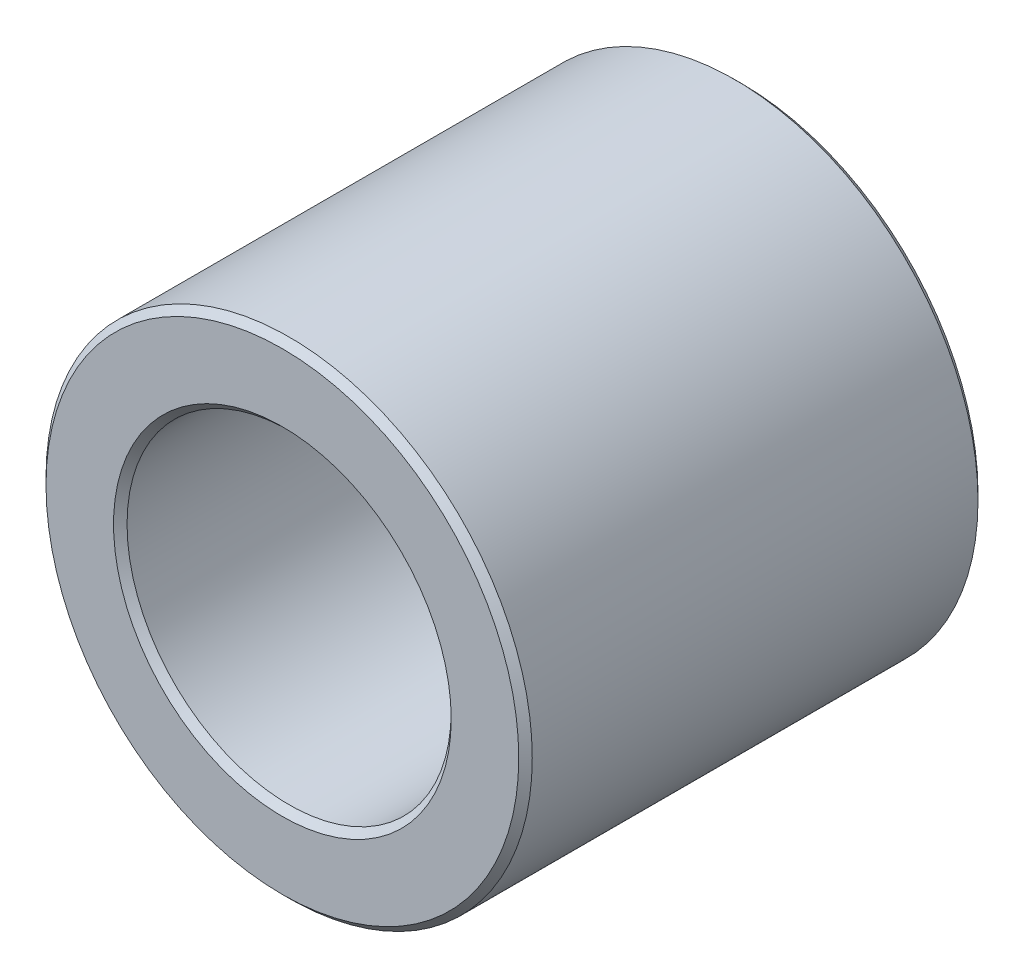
ISO-10303-21;
HEADER;
FILE_DESCRIPTION(('STEP AP214'),'2;1');
FILE_NAME('part.step','',(''),(''),'','','');
FILE_SCHEMA(('AUTOMOTIVE_DESIGN { 1 0 10303 214 1 1 1 1 }'));
ENDSEC;
DATA;
#1=APPLICATION_CONTEXT('core data for automotive mechanical design processes');
#2=APPLICATION_PROTOCOL_DEFINITION('international standard','automotive_design',2000,#1);
#3=PRODUCT_CONTEXT('',#1,'mechanical');
#4=PRODUCT('Part','Part','',(#3));
#5=PRODUCT_RELATED_PRODUCT_CATEGORY('part','',(#4));
#6=PRODUCT_DEFINITION_FORMATION('','',#4);
#7=PRODUCT_DEFINITION_CONTEXT('part definition',#1,'design');
#8=PRODUCT_DEFINITION('design','',#6,#7);
#9=PRODUCT_DEFINITION_SHAPE('','',#8);
#10=(LENGTH_UNIT() NAMED_UNIT(*) SI_UNIT(.MILLI.,.METRE.));
#11=(NAMED_UNIT(*) PLANE_ANGLE_UNIT() SI_UNIT($,.RADIAN.));
#12=(NAMED_UNIT(*) SI_UNIT($,.STERADIAN.) SOLID_ANGLE_UNIT());
#13=UNCERTAINTY_MEASURE_WITH_UNIT(LENGTH_MEASURE(1.E-05),#10,'distance_accuracy_value','');
#14=(GEOMETRIC_REPRESENTATION_CONTEXT(3) GLOBAL_UNCERTAINTY_ASSIGNED_CONTEXT((#13)) GLOBAL_UNIT_ASSIGNED_CONTEXT((#10,
#11,#12)) REPRESENTATION_CONTEXT('',''));
#15=CARTESIAN_POINT('',(0.,0.,0.));
#16=DIRECTION('',(0.,0.,1.));
#17=DIRECTION('',(1.,0.,0.));
#18=AXIS2_PLACEMENT_3D('',#15,#16,#17);
#19=CARTESIAN_POINT('',(0.,0.,-17.));
#20=DIRECTION('',(0.,0.,1.));
#21=DIRECTION('',(1.,0.,0.));
#22=AXIS2_PLACEMENT_3D('',#19,#20,#21);
#23=CYLINDRICAL_SURFACE('',#22,9.);
#24=CARTESIAN_POINT('',(0.,0.,-16.75));
#25=DIRECTION('',(0.,0.,1.));
#26=DIRECTION('',(1.,0.,0.));
#27=AXIS2_PLACEMENT_3D('',#24,#25,#26);
#28=CIRCLE('',#27,9.);
#29=CARTESIAN_POINT('',(9.,0.,-16.75));
#30=VERTEX_POINT('',#29);
#31=EDGE_CURVE('E53',#30,#30,#28,.T.);
#32=ORIENTED_EDGE('',*,*,#31,.T.);
#33=EDGE_LOOP('',(#32));
#34=FACE_BOUND('',#33,.T.);
#35=CARTESIAN_POINT('',(0.,0.,-0.25));
#36=DIRECTION('',(0.,0.,1.));
#37=DIRECTION('',(1.,0.,0.));
#38=AXIS2_PLACEMENT_3D('',#35,#36,#37);
#39=CIRCLE('',#38,9.);
#40=CARTESIAN_POINT('',(9.,0.,-0.25));
#41=VERTEX_POINT('',#40);
#42=EDGE_CURVE('E56',#41,#41,#39,.F.);
#43=ORIENTED_EDGE('',*,*,#42,.T.);
#44=EDGE_LOOP('',(#43));
#45=FACE_BOUND('',#44,.T.);
#46=ADVANCED_FACE('F28',(#34,#45),#23,.T.);
#47=CARTESIAN_POINT('',(0.,0.,-17.));
#48=DIRECTION('',(0.,0.,1.));
#49=DIRECTION('',(1.,0.,0.));
#50=AXIS2_PLACEMENT_3D('',#47,#48,#49);
#51=PLANE('',#50);
#52=CARTESIAN_POINT('',(0.,0.,-17.));
#53=DIRECTION('',(0.,0.,1.));
#54=DIRECTION('',(1.,0.,0.));
#55=AXIS2_PLACEMENT_3D('',#52,#53,#54);
#56=CIRCLE('',#55,8.75);
#57=CARTESIAN_POINT('',(8.75,0.,-17.));
#58=VERTEX_POINT('',#57);
#59=EDGE_CURVE('E47',#58,#58,#56,.F.);
#60=ORIENTED_EDGE('',*,*,#59,.T.);
#61=EDGE_LOOP('',(#60));
#62=FACE_BOUND('',#61,.T.);
#63=CARTESIAN_POINT('',(0.,0.,-17.));
#64=DIRECTION('',(0.,0.,1.));
#65=DIRECTION('',(1.,0.,0.));
#66=AXIS2_PLACEMENT_3D('',#63,#64,#65);
#67=CIRCLE('',#66,6.25);
#68=CARTESIAN_POINT('',(6.25,0.,-17.));
#69=VERTEX_POINT('',#68);
#70=EDGE_CURVE('E50',#69,#69,#67,.T.);
#71=ORIENTED_EDGE('',*,*,#70,.T.);
#72=EDGE_LOOP('',(#71));
#73=FACE_BOUND('',#72,.T.);
#74=ADVANCED_FACE('F77',(#62,#73),#51,.F.);
#75=CARTESIAN_POINT('',(0.,0.,0.));
#76=DIRECTION('',(0.,0.,1.));
#77=DIRECTION('',(1.,0.,0.));
#78=AXIS2_PLACEMENT_3D('',#75,#76,#77);
#79=PLANE('',#78);
#80=CARTESIAN_POINT('',(0.,0.,0.));
#81=DIRECTION('',(0.,0.,1.));
#82=DIRECTION('',(1.,0.,0.));
#83=AXIS2_PLACEMENT_3D('',#80,#81,#82);
#84=CIRCLE('',#83,8.75);
#85=CARTESIAN_POINT('',(8.75,0.,0.));
#86=VERTEX_POINT('',#85);
#87=EDGE_CURVE('E10',#86,#86,#84,.T.);
#88=ORIENTED_EDGE('',*,*,#87,.T.);
#89=EDGE_LOOP('',(#88));
#90=FACE_BOUND('',#89,.T.);
#91=CARTESIAN_POINT('',(0.,0.,0.));
#92=DIRECTION('',(0.,0.,1.));
#93=DIRECTION('',(1.,0.,0.));
#94=AXIS2_PLACEMENT_3D('',#91,#92,#93);
#95=CIRCLE('',#94,6.25);
#96=CARTESIAN_POINT('',(6.25,0.,0.));
#97=VERTEX_POINT('',#96);
#98=EDGE_CURVE('E34',#97,#97,#95,.F.);
#99=ORIENTED_EDGE('',*,*,#98,.T.);
#100=EDGE_LOOP('',(#99));
#101=FACE_BOUND('',#100,.T.);
#102=ADVANCED_FACE('F82',(#90,#101),#79,.T.);
#103=CARTESIAN_POINT('',(0.,0.,-17.));
#104=DIRECTION('',(0.,0.,1.));
#105=DIRECTION('',(1.,0.,0.));
#106=AXIS2_PLACEMENT_3D('',#103,#104,#105);
#107=CYLINDRICAL_SURFACE('',#106,6.);
#108=CARTESIAN_POINT('',(0.,0.,-16.75));
#109=DIRECTION('',(0.,0.,1.));
#110=DIRECTION('',(1.,0.,0.));
#111=AXIS2_PLACEMENT_3D('',#108,#109,#110);
#112=CIRCLE('',#111,6.);
#113=CARTESIAN_POINT('',(6.,0.,-16.75));
#114=VERTEX_POINT('',#113);
#115=EDGE_CURVE('E38',#114,#114,#112,.F.);
#116=ORIENTED_EDGE('',*,*,#115,.T.);
#117=EDGE_LOOP('',(#116));
#118=FACE_BOUND('',#117,.T.);
#119=CARTESIAN_POINT('',(0.,0.,-0.25));
#120=DIRECTION('',(0.,0.,1.));
#121=DIRECTION('',(1.,0.,0.));
#122=AXIS2_PLACEMENT_3D('',#119,#120,#121);
#123=CIRCLE('',#122,6.);
#124=CARTESIAN_POINT('',(6.,0.,-0.25));
#125=VERTEX_POINT('',#124);
#126=EDGE_CURVE('E42',#125,#125,#123,.T.);
#127=ORIENTED_EDGE('',*,*,#126,.T.);
#128=EDGE_LOOP('',(#127));
#129=FACE_BOUND('',#128,.T.);
#130=ADVANCED_FACE('F87',(#118,#129),#107,.F.);
#131=CARTESIAN_POINT('',(0.,0.,-16.75));
#132=DIRECTION('',(0.,0.,1.));
#133=DIRECTION('',(1.,0.,0.));
#134=AXIS2_PLACEMENT_3D('',#131,#132,#133);
#135=CONICAL_SURFACE('',#134,9.,0.785398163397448);
#136=ORIENTED_EDGE('',*,*,#59,.F.);
#137=EDGE_LOOP('',(#136));
#138=FACE_BOUND('',#137,.T.);
#139=ORIENTED_EDGE('',*,*,#31,.F.);
#140=EDGE_LOOP('',(#139));
#141=FACE_BOUND('',#140,.T.);
#142=ADVANCED_FACE('F73',(#138,#141),#135,.T.);
#143=CARTESIAN_POINT('',(0.,0.,-17.));
#144=DIRECTION('',(0.,0.,-1.));
#145=DIRECTION('',(-1.,0.,0.));
#146=AXIS2_PLACEMENT_3D('',#143,#144,#145);
#147=CONICAL_SURFACE('',#146,6.25,0.785398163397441);
#148=ORIENTED_EDGE('',*,*,#115,.F.);
#149=EDGE_LOOP('',(#148));
#150=FACE_BOUND('',#149,.T.);
#151=ORIENTED_EDGE('',*,*,#70,.F.);
#152=EDGE_LOOP('',(#151));
#153=FACE_BOUND('',#152,.T.);
#154=ADVANCED_FACE('F65',(#150,#153),#147,.F.);
#155=CARTESIAN_POINT('',(0.,0.,0.));
#156=DIRECTION('',(0.,0.,-1.));
#157=DIRECTION('',(-1.,0.,0.));
#158=AXIS2_PLACEMENT_3D('',#155,#156,#157);
#159=CONICAL_SURFACE('',#158,8.75,0.785398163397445);
#160=ORIENTED_EDGE('',*,*,#42,.F.);
#161=EDGE_LOOP('',(#160));
#162=FACE_BOUND('',#161,.T.);
#163=ORIENTED_EDGE('',*,*,#87,.F.);
#164=EDGE_LOOP('',(#163));
#165=FACE_BOUND('',#164,.T.);
#166=ADVANCED_FACE('F61',(#162,#165),#159,.T.);
#167=CARTESIAN_POINT('',(0.,0.,-0.25));
#168=DIRECTION('',(0.,0.,1.));
#169=DIRECTION('',(1.,0.,0.));
#170=AXIS2_PLACEMENT_3D('',#167,#168,#169);
#171=CONICAL_SURFACE('',#170,6.,0.78539816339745);
#172=ORIENTED_EDGE('',*,*,#98,.F.);
#173=EDGE_LOOP('',(#172));
#174=FACE_BOUND('',#173,.T.);
#175=ORIENTED_EDGE('',*,*,#126,.F.);
#176=EDGE_LOOP('',(#175));
#177=FACE_BOUND('',#176,.T.);
#178=ADVANCED_FACE('F64',(#174,#177),#171,.F.);
#179=CLOSED_SHELL('',(#46,#74,#102,#130,#142,#154,#166,#178));
#180=MANIFOLD_SOLID_BREP('B2',#179);
#181=ADVANCED_BREP_SHAPE_REPRESENTATION('',(#18,#180),#14);
#182=SHAPE_DEFINITION_REPRESENTATION(#9,#181);
ENDSEC;
END-ISO-10303-21;
